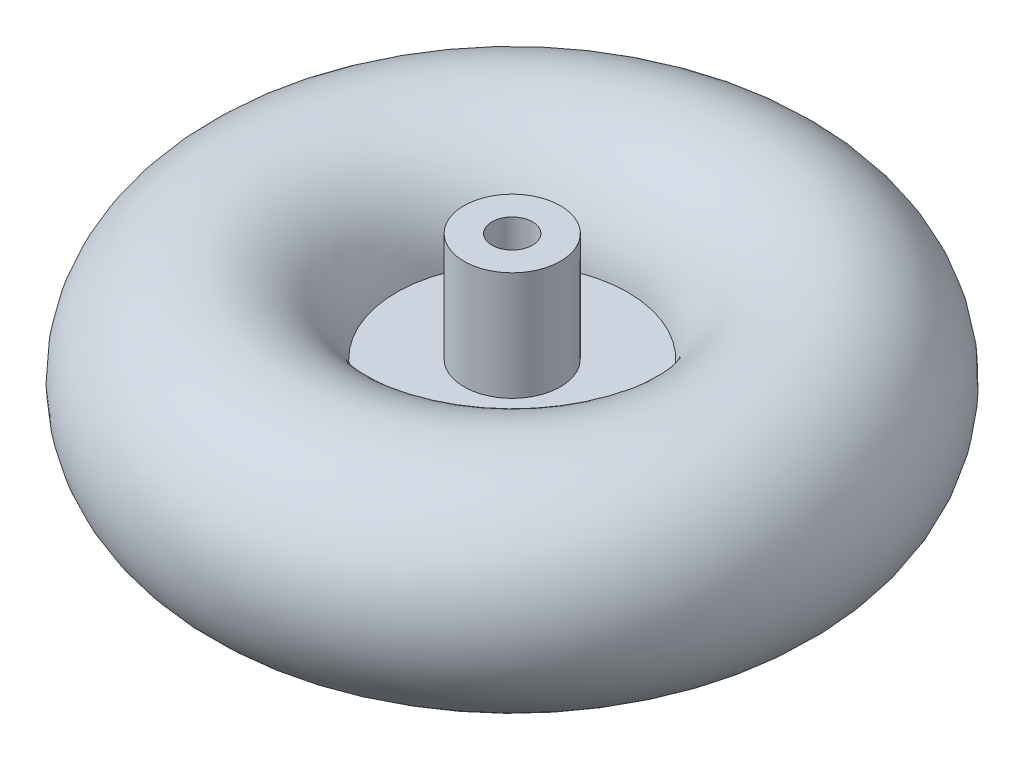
ISO-10303-21;
HEADER;
FILE_DESCRIPTION(('STEP AP214'),'2;1');
FILE_NAME('part.step','',(''),(''),'','','');
FILE_SCHEMA(('AUTOMOTIVE_DESIGN { 1 0 10303 214 1 1 1 1 }'));
ENDSEC;
DATA;
#1=APPLICATION_CONTEXT('core data for automotive mechanical design processes');
#2=APPLICATION_PROTOCOL_DEFINITION('international standard','automotive_design',2000,#1);
#3=PRODUCT_CONTEXT('',#1,'mechanical');
#4=PRODUCT('Part','Part','',(#3));
#5=PRODUCT_RELATED_PRODUCT_CATEGORY('part','',(#4));
#6=PRODUCT_DEFINITION_FORMATION('','',#4);
#7=PRODUCT_DEFINITION_CONTEXT('part definition',#1,'design');
#8=PRODUCT_DEFINITION('design','',#6,#7);
#9=PRODUCT_DEFINITION_SHAPE('','',#8);
#10=(LENGTH_UNIT() NAMED_UNIT(*) SI_UNIT(.MILLI.,.METRE.));
#11=(NAMED_UNIT(*) PLANE_ANGLE_UNIT() SI_UNIT($,.RADIAN.));
#12=(NAMED_UNIT(*) SI_UNIT($,.STERADIAN.) SOLID_ANGLE_UNIT());
#13=UNCERTAINTY_MEASURE_WITH_UNIT(LENGTH_MEASURE(1.E-05),#10,'distance_accuracy_value','');
#14=(GEOMETRIC_REPRESENTATION_CONTEXT(3) GLOBAL_UNCERTAINTY_ASSIGNED_CONTEXT((#13)) GLOBAL_UNIT_ASSIGNED_CONTEXT((#10,
#11,#12)) REPRESENTATION_CONTEXT('',''));
#15=CARTESIAN_POINT('',(0.,0.,0.));
#16=DIRECTION('',(0.,0.,1.));
#17=DIRECTION('',(1.,0.,0.));
#18=AXIS2_PLACEMENT_3D('',#15,#16,#17);
#19=CARTESIAN_POINT('',(-19.,7.12669405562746,0.));
#20=DIRECTION('',(0.,-1.,0.));
#21=DIRECTION('',(0.,0.,-1.));
#22=AXIS2_PLACEMENT_3D('',#19,#20,#21);
#23=PLANE('',#22);
#24=CARTESIAN_POINT('',(0.,7.12669405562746,0.));
#25=DIRECTION('',(0.,-1.,0.));
#26=DIRECTION('',(0.,0.,-1.));
#27=AXIS2_PLACEMENT_3D('',#24,#25,#26);
#28=CIRCLE('',#27,45.6017872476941);
#29=CARTESIAN_POINT('',(0.,7.12669405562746,-45.6017872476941));
#30=VERTEX_POINT('',#29);
#31=EDGE_CURVE('E10',#30,#30,#28,.T.);
#32=ORIENTED_EDGE('',*,*,#31,.F.);
#33=EDGE_LOOP('',(#32));
#34=FACE_BOUND('',#33,.T.);
#35=CARTESIAN_POINT('',(0.,7.12669405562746,0.));
#36=DIRECTION('',(0.,-1.,0.));
#37=DIRECTION('',(0.,0.,-1.));
#38=AXIS2_PLACEMENT_3D('',#35,#36,#37);
#39=CIRCLE('',#38,19.);
#40=CARTESIAN_POINT('',(0.,7.12669405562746,-19.));
#41=VERTEX_POINT('',#40);
#42=EDGE_CURVE('E52',#41,#41,#39,.T.);
#43=ORIENTED_EDGE('',*,*,#42,.T.);
#44=EDGE_LOOP('',(#43));
#45=FACE_BOUND('',#44,.T.);
#46=ADVANCED_FACE('F30',(#34,#45),#23,.F.);
#47=CARTESIAN_POINT('',(0.,0.,0.));
#48=DIRECTION('',(0.,-1.,0.));
#49=DIRECTION('',(0.,0.,-1.));
#50=AXIS2_PLACEMENT_3D('',#47,#48,#49);
#51=TOROIDAL_SURFACE('',#50,87.5,42.5);
#52=CARTESIAN_POINT('',(0.,0.,0.));
#53=DIRECTION('',(0.,-1.,0.));
#54=DIRECTION('',(0.,0.,-1.));
#55=AXIS2_PLACEMENT_3D('',#52,#53,#54);
#56=CIRCLE('',#55,45.);
#57=CARTESIAN_POINT('',(0.,0.,-45.));
#58=VERTEX_POINT('',#57);
#59=EDGE_CURVE('E36',#58,#58,#56,.T.);
#60=ORIENTED_EDGE('',*,*,#59,.F.);
#61=EDGE_LOOP('',(#60));
#62=FACE_BOUND('',#61,.T.);
#63=ORIENTED_EDGE('',*,*,#31,.T.);
#64=EDGE_LOOP('',(#63));
#65=FACE_BOUND('',#64,.T.);
#66=ADVANCED_FACE('F77',(#62,#65),#51,.T.);
#67=CARTESIAN_POINT('',(-7.99999999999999,0.,0.));
#68=DIRECTION('',(0.,1.,0.));
#69=DIRECTION('',(0.,0.,1.));
#70=AXIS2_PLACEMENT_3D('',#67,#68,#69);
#71=PLANE('',#70);
#72=CARTESIAN_POINT('',(0.,0.,0.));
#73=DIRECTION('',(0.,-1.,0.));
#74=DIRECTION('',(0.,0.,-1.));
#75=AXIS2_PLACEMENT_3D('',#72,#73,#74);
#76=CIRCLE('',#75,7.99999999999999);
#77=CARTESIAN_POINT('',(0.,0.,-7.99999999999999));
#78=VERTEX_POINT('',#77);
#79=EDGE_CURVE('E40',#78,#78,#76,.T.);
#80=ORIENTED_EDGE('',*,*,#79,.F.);
#81=EDGE_LOOP('',(#80));
#82=FACE_BOUND('',#81,.T.);
#83=ORIENTED_EDGE('',*,*,#59,.T.);
#84=EDGE_LOOP('',(#83));
#85=FACE_BOUND('',#84,.T.);
#86=ADVANCED_FACE('F72',(#82,#85),#71,.F.);
#87=CARTESIAN_POINT('',(0.,0.,0.));
#88=DIRECTION('',(0.,-1.,0.));
#89=DIRECTION('',(0.,0.,-1.));
#90=AXIS2_PLACEMENT_3D('',#87,#88,#89);
#91=CYLINDRICAL_SURFACE('',#90,8.);
#92=CARTESIAN_POINT('',(0.,50.,0.));
#93=DIRECTION('',(0.,-1.,0.));
#94=DIRECTION('',(0.,0.,-1.));
#95=AXIS2_PLACEMENT_3D('',#92,#93,#94);
#96=CIRCLE('',#95,8.);
#97=CARTESIAN_POINT('',(0.,50.,-8.));
#98=VERTEX_POINT('',#97);
#99=EDGE_CURVE('E44',#98,#98,#96,.T.);
#100=ORIENTED_EDGE('',*,*,#99,.F.);
#101=EDGE_LOOP('',(#100));
#102=FACE_BOUND('',#101,.T.);
#103=ORIENTED_EDGE('',*,*,#79,.T.);
#104=EDGE_LOOP('',(#103));
#105=FACE_BOUND('',#104,.T.);
#106=ADVANCED_FACE('F66',(#102,#105),#91,.F.);
#107=CARTESIAN_POINT('',(-8.,50.,0.));
#108=DIRECTION('',(0.,-1.,0.));
#109=DIRECTION('',(0.,0.,-1.));
#110=AXIS2_PLACEMENT_3D('',#107,#108,#109);
#111=PLANE('',#110);
#112=CARTESIAN_POINT('',(0.,50.,0.));
#113=DIRECTION('',(0.,-1.,0.));
#114=DIRECTION('',(0.,0.,-1.));
#115=AXIS2_PLACEMENT_3D('',#112,#113,#114);
#116=CIRCLE('',#115,19.);
#117=CARTESIAN_POINT('',(0.,50.,-19.));
#118=VERTEX_POINT('',#117);
#119=EDGE_CURVE('E49',#118,#118,#116,.T.);
#120=ORIENTED_EDGE('',*,*,#119,.F.);
#121=EDGE_LOOP('',(#120));
#122=FACE_BOUND('',#121,.T.);
#123=ORIENTED_EDGE('',*,*,#99,.T.);
#124=EDGE_LOOP('',(#123));
#125=FACE_BOUND('',#124,.T.);
#126=ADVANCED_FACE('F60',(#122,#125),#111,.F.);
#127=CARTESIAN_POINT('',(0.,0.,0.));
#128=DIRECTION('',(0.,-1.,0.));
#129=DIRECTION('',(0.,0.,-1.));
#130=AXIS2_PLACEMENT_3D('',#127,#128,#129);
#131=CYLINDRICAL_SURFACE('',#130,19.);
#132=ORIENTED_EDGE('',*,*,#42,.F.);
#133=EDGE_LOOP('',(#132));
#134=FACE_BOUND('',#133,.T.);
#135=ORIENTED_EDGE('',*,*,#119,.T.);
#136=EDGE_LOOP('',(#135));
#137=FACE_BOUND('',#136,.T.);
#138=ADVANCED_FACE('F57',(#134,#137),#131,.T.);
#139=CLOSED_SHELL('',(#46,#66,#86,#106,#126,#138));
#140=MANIFOLD_SOLID_BREP('B2',#139);
#141=ADVANCED_BREP_SHAPE_REPRESENTATION('',(#18,#140),#14);
#142=SHAPE_DEFINITION_REPRESENTATION(#9,#141);
ENDSEC;
END-ISO-10303-21;
